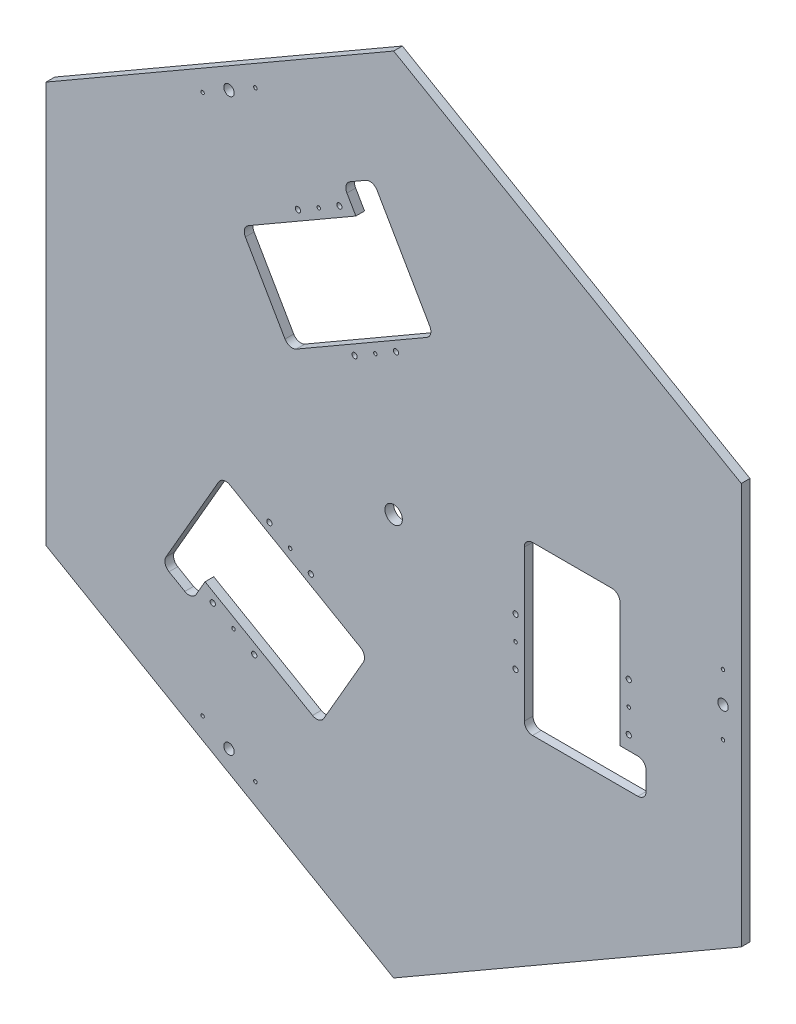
from build123d import *

# Parameters (mm, degrees)
ESQUISSE1_R        = 10
ESQUISSE1_R_2      = 3
ESQUISSE1_R_3      = 2
ESQUISSE1_R_4      = 6
BOSS_EXTRU_1_DEPTH = 10


with BuildPart() as part:
    # Esquisse1 → Boss.-Extru.1 (new body)
    with BuildSketch(Plane.XY):
        Polygon((399.237711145, 230.5), (0, 461), (-399.237711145, 230.5), (-399.237711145, -230.5), (0, -461), (399.237711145, -230.5), align=None)
        Circle(ESQUISSE1_R, mode=Mode.SUBTRACT)
        with Locations((140, -29)):
            Circle(ESQUISSE1_R_2, mode=Mode.SUBTRACT)
        with Locations((140, -56.5)):
            Circle(ESQUISSE1_R_3, mode=Mode.SUBTRACT)
        with Locations((140, -84)):
            Circle(ESQUISSE1_R_2, mode=Mode.SUBTRACT)
        with Locations((378.237711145, 0)):
            Circle(ESQUISSE1_R_4, mode=Mode.SUBTRACT)
        with Locations((378.237711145, 35)):
            Circle(ESQUISSE1_R_3, mode=Mode.SUBTRACT)
        with Locations((378.237711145, -35)):
            Circle(ESQUISSE1_R_3, mode=Mode.SUBTRACT)
        with Locations(Location((270, -84, 0), (0, 0, 180))):
            Circle(ESQUISSE1_R_2, mode=Mode.SUBTRACT)
        with Locations(Location((270, -56.5, 0), (0, 0, 180))):
            Circle(ESQUISSE1_R_3, mode=Mode.SUBTRACT)
        with Locations(Location((270, -29, 0), (0, 0, 180))):
            Circle(ESQUISSE1_R_2, mode=Mode.SUBTRACT)
        with Locations((-95.11473671, -106.74355653)):
            Circle(ESQUISSE1_R_2, mode=Mode.SUBTRACT)
        with Locations((-118.930435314, -92.99355653)):
            Circle(ESQUISSE1_R_3, mode=Mode.SUBTRACT)
        with Locations((-142.746133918, -79.24355653)):
            Circle(ESQUISSE1_R_2, mode=Mode.SUBTRACT)
        with Locations(Location((-207.746133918, -191.826859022, 0), (0, 0, 180))):
            Circle(ESQUISSE1_R_2, mode=Mode.SUBTRACT)
        with Locations(Location((-183.930435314, -205.576859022, 0), (0, 0, 180))):
            Circle(ESQUISSE1_R_3, mode=Mode.SUBTRACT)
        with Locations(Location((-160.11473671, -219.326859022, 0), (0, 0, 180))):
            Circle(ESQUISSE1_R_2, mode=Mode.SUBTRACT)
        with Locations((-189.118855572, -327.563466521)):
            Circle(ESQUISSE1_R_4, mode=Mode.SUBTRACT)
        with Locations((-158.80796644, -345.063466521)):
            Circle(ESQUISSE1_R_3, mode=Mode.SUBTRACT)
        with Locations((-219.429744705, -310.063466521)):
            Circle(ESQUISSE1_R_3, mode=Mode.SUBTRACT)
        with Locations((-44.88526329, 135.74355653)):
            Circle(ESQUISSE1_R_2, mode=Mode.SUBTRACT)
        with Locations((-21.069564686, 149.49355653)):
            Circle(ESQUISSE1_R_3, mode=Mode.SUBTRACT)
        with Locations((2.746133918, 163.24355653)):
            Circle(ESQUISSE1_R_2, mode=Mode.SUBTRACT)
        with Locations(Location((-62.253866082, 275.826859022, 0), (0, 0, 180))):
            Circle(ESQUISSE1_R_2, mode=Mode.SUBTRACT)
        with Locations(Location((-86.069564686, 262.076859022, 0), (0, 0, 180))):
            Circle(ESQUISSE1_R_3, mode=Mode.SUBTRACT)
        with Locations(Location((-109.88526329, 248.326859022, 0), (0, 0, 180))):
            Circle(ESQUISSE1_R_2, mode=Mode.SUBTRACT)
        with Locations((-189.118855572, 327.56346652)):
            Circle(ESQUISSE1_R_4, mode=Mode.SUBTRACT)
        with Locations((-219.429744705, 310.06346652)):
            Circle(ESQUISSE1_R_3, mode=Mode.SUBTRACT)
        with Locations((-158.80796644, 345.06346652)):
            Circle(ESQUISSE1_R_3, mode=Mode.SUBTRACT)
        with BuildLine():
            Line((150, 42.5), (150, -130.5))
            ThreePointArc((150, -130.5), (152.782485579, -137.217514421), (159.5, -140))
            Line((159.5, -140), (280.5, -140))
            ThreePointArc((280.5, -140), (287.217514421, -137.217514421), (290, -130.5))
            Line((290, -130.5), (290, -109.5))
            ThreePointArc((290, -109.5), (287.217514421, -102.782485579), (280.5, -100))
            Line((280.5, -100), (260, -100))
            Line((260, -100), (260, 42.5))
            ThreePointArc((260, 42.5), (257.217514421, 49.217514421), (250.5, 52))
            Line((250.5, 52), (159.5, 52))
            ThreePointArc((159.5, 52), (152.782485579, 49.217514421), (150, 42.5))
        make_face(mode=Mode.SUBTRACT)
        with BuildLine():
            Line((-80.216679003, -242.939363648), (-34.716679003, -164.131051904))
            ThreePointArc((-34.716679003, -164.131051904), (-33.767624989, -156.922270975), (-38.193920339, -151.153810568))
            Line((-38.193920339, -151.153810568), (-188.016315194, -64.653810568))
            ThreePointArc((-188.016315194, -64.653810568), (-195.225096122, -63.704756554), (-200.99355653, -68.131051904))
            Line((-200.99355653, -68.131051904), (-261.49355653, -172.920125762))
            ThreePointArc((-261.49355653, -172.920125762), (-262.442610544, -180.12890669), (-258.016315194, -185.897367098))
            Line((-258.016315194, -185.897367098), (-239.829781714, -196.397367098))
            ThreePointArc((-239.829781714, -196.397367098), (-232.621000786, -197.346421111), (-226.852540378, -192.920125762))
            Line((-226.852540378, -192.920125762), (-216.602540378, -175.166604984))
            Line((-216.602540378, -175.166604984), (-93.193920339, -246.416604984))
            ThreePointArc((-93.193920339, -246.416604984), (-85.985139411, -247.365658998), (-80.216679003, -242.939363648))
        make_face(mode=Mode.SUBTRACT)
        with BuildLine():
            Line((-170.283320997, 190.939363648), (-124.783320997, 112.131051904))
            ThreePointArc((-124.783320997, 112.131051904), (-119.014860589, 107.704756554), (-111.806079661, 108.653810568))
            Line((-111.806079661, 108.653810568), (38.016315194, 195.153810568))
            ThreePointArc((38.016315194, 195.153810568), (42.442610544, 200.922270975), (41.49355653, 208.131051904))
            Line((41.49355653, 208.131051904), (-19.00644347, 312.920125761))
            ThreePointArc((-19.00644347, 312.920125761), (-24.774903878, 317.346421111), (-31.983684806, 316.397367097))
            Line((-31.983684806, 316.397367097), (-50.170218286, 305.897367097))
            ThreePointArc((-50.170218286, 305.897367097), (-54.596513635, 300.12890669), (-53.647459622, 292.920125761))
            Line((-53.647459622, 292.920125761), (-43.397459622, 275.166604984))
            Line((-43.397459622, 275.166604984), (-166.806079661, 203.916604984))
            ThreePointArc((-166.806079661, 203.916604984), (-171.232375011, 198.148144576), (-170.283320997, 190.939363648))
        make_face(mode=Mode.SUBTRACT)
    extrude(amount=BOSS_EXTRU_1_DEPTH)


solid = part.part
